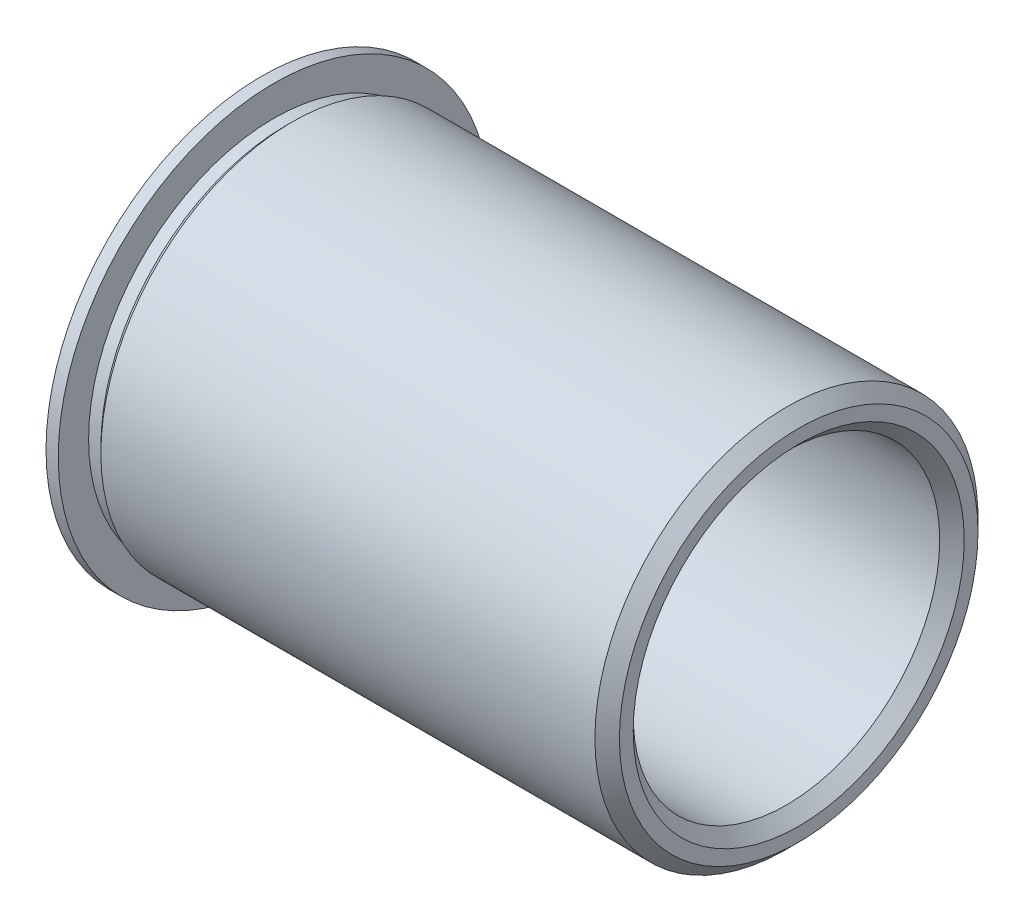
from build123d import *

# Parameters (mm, degrees)
SKETCH3_R          = 3.175
CUT_EXTRUDE1_DEPTH = 100.845585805
CHAMFER2_SIZE      = 0.254
CHAMFER3_SIZE      = 0.254


with BuildPart() as part:
    # Sketch2 → Revolve3 (revolve)
    with BuildSketch(Plane.XY, mode=Mode.PRIVATE) as revolve3_sk:
        Polygon((-56.216282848, 94.652687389), (-56.216282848, 99.123087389), (-55.962282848, 99.123087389), (-55.962282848, 98.494437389), (-55.708282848, 98.494437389), (-55.581282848, 98.621437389), (-45.345082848, 98.621437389), (-45.091082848, 98.367437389), (-45.091082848, 94.652687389), align=None)
    revolve(revolve3_sk.sketch.rotate(Axis((-56.216282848, 94.652687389, 0), (1, 0, 0)), 90), axis=Axis((-56.216282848, 94.652687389, 0), (1, 0, 0)))

    # Sketch3 → Cut-Extrude1 (cut, through all)
    with BuildSketch(Plane(origin=(-45.091082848, 0, 0), x_dir=(0, 0, -1), z_dir=(1, 0, 0))):
        with Locations((0, 94.652687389)):
            Circle(SKETCH3_R)
    extrude(amount=-CUT_EXTRUDE1_DEPTH, mode=Mode.SUBTRACT)

    # Chamfer2
    chamfer2_edges = [part.edges().sort_by_distance(p)[0] for p in [
        (-56.216282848, 94.652687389, 3.175),
    ]]
    chamfer(chamfer2_edges, length=CHAMFER2_SIZE)

    # Chamfer3
    chamfer3_edges = [part.edges().sort_by_distance(p)[0] for p in [
        (-45.091082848, 94.652687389, 3.175),
    ]]
    chamfer(chamfer3_edges, length=CHAMFER3_SIZE)


solid = part.part
